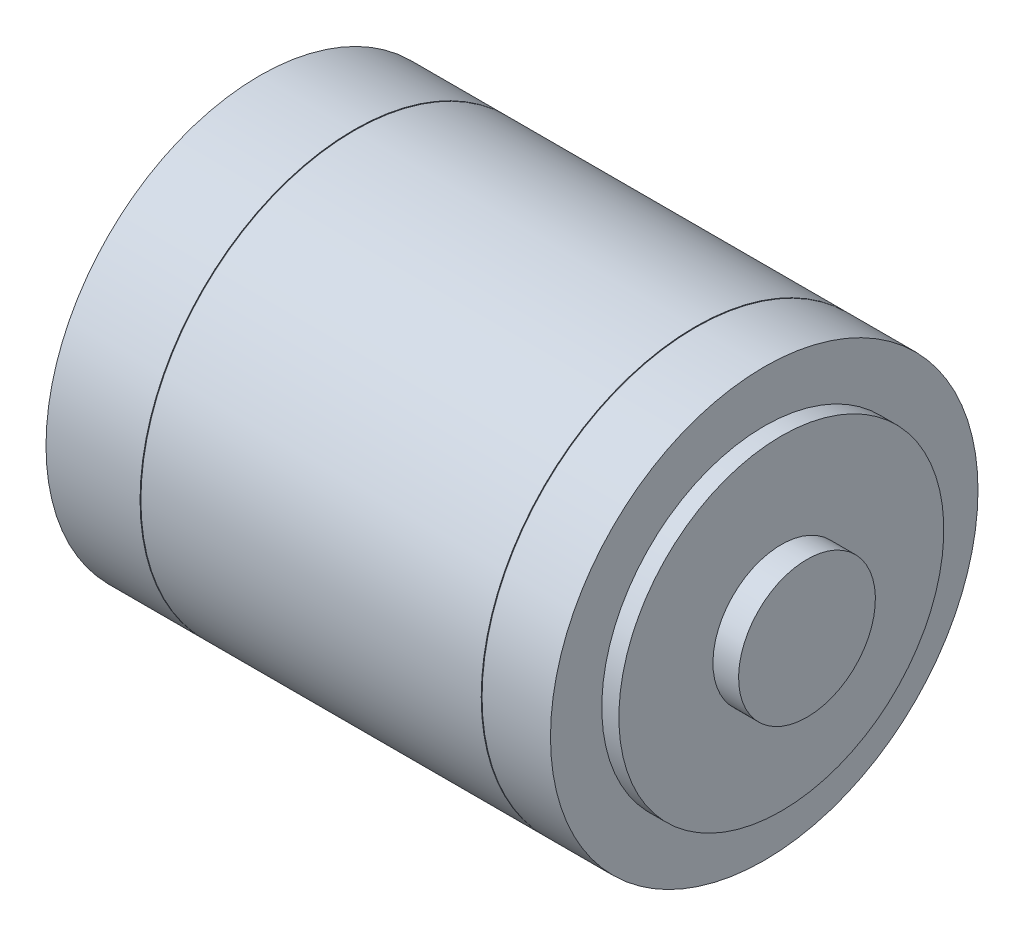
ISO-10303-21;
HEADER;
FILE_DESCRIPTION(('STEP AP214'),'2;1');
FILE_NAME('part.step','',(''),(''),'','','');
FILE_SCHEMA(('AUTOMOTIVE_DESIGN { 1 0 10303 214 1 1 1 1 }'));
ENDSEC;
DATA;
#1=APPLICATION_CONTEXT('core data for automotive mechanical design processes');
#2=APPLICATION_PROTOCOL_DEFINITION('international standard','automotive_design',2000,#1);
#3=PRODUCT_CONTEXT('',#1,'mechanical');
#4=PRODUCT('Part','Part','',(#3));
#5=PRODUCT_RELATED_PRODUCT_CATEGORY('part','',(#4));
#6=PRODUCT_DEFINITION_FORMATION('','',#4);
#7=PRODUCT_DEFINITION_CONTEXT('part definition',#1,'design');
#8=PRODUCT_DEFINITION('design','',#6,#7);
#9=PRODUCT_DEFINITION_SHAPE('','',#8);
#10=(LENGTH_UNIT() NAMED_UNIT(*) SI_UNIT(.MILLI.,.METRE.));
#11=(NAMED_UNIT(*) PLANE_ANGLE_UNIT() SI_UNIT($,.RADIAN.));
#12=(NAMED_UNIT(*) SI_UNIT($,.STERADIAN.) SOLID_ANGLE_UNIT());
#13=UNCERTAINTY_MEASURE_WITH_UNIT(LENGTH_MEASURE(1.E-05),#10,'distance_accuracy_value','');
#14=(GEOMETRIC_REPRESENTATION_CONTEXT(3) GLOBAL_UNCERTAINTY_ASSIGNED_CONTEXT((#13)) GLOBAL_UNIT_ASSIGNED_CONTEXT((#10,
#11,#12)) REPRESENTATION_CONTEXT('',''));
#15=CARTESIAN_POINT('',(0.,0.,0.));
#16=DIRECTION('',(0.,0.,1.));
#17=DIRECTION('',(1.,0.,0.));
#18=AXIS2_PLACEMENT_3D('',#15,#16,#17);
#19=CARTESIAN_POINT('',(-64.,15.,0.));
#20=DIRECTION('',(1.,0.,0.));
#21=DIRECTION('',(0.,1.,0.));
#22=AXIS2_PLACEMENT_3D('',#19,#20,#21);
#23=PLANE('',#22);
#24=CARTESIAN_POINT('',(-64.,-9.99999999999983,-17.3205080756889));
#25=DIRECTION('',(-1.,0.,0.));
#26=DIRECTION('',(0.,0.,1.));
#27=AXIS2_PLACEMENT_3D('',#24,#25,#26);
#28=CIRCLE('',#27,2.09999999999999);
#29=CARTESIAN_POINT('',(-64.,-9.99999999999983,-15.2205080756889));
#30=VERTEX_POINT('',#29);
#31=EDGE_CURVE('E84',#30,#30,#28,.T.);
#32=ORIENTED_EDGE('',*,*,#31,.F.);
#33=EDGE_LOOP('',(#32));
#34=FACE_BOUND('',#33,.T.);
#35=CARTESIAN_POINT('',(-64.,-10.0000000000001,17.3205080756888));
#36=DIRECTION('',(-1.,0.,0.));
#37=DIRECTION('',(0.,0.,1.));
#38=AXIS2_PLACEMENT_3D('',#35,#36,#37);
#39=CIRCLE('',#38,2.09999999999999);
#40=CARTESIAN_POINT('',(-64.,-10.0000000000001,19.4205080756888));
#41=VERTEX_POINT('',#40);
#42=EDGE_CURVE('E96',#41,#41,#39,.T.);
#43=ORIENTED_EDGE('',*,*,#42,.F.);
#44=EDGE_LOOP('',(#43));
#45=FACE_BOUND('',#44,.T.);
#46=CARTESIAN_POINT('',(-64.,0.,0.));
#47=DIRECTION('',(-1.,0.,0.));
#48=DIRECTION('',(0.,-1.,0.));
#49=AXIS2_PLACEMENT_3D('',#46,#47,#48);
#50=CIRCLE('',#49,25.);
#51=CARTESIAN_POINT('',(-64.,-25.,0.));
#52=VERTEX_POINT('',#51);
#53=EDGE_CURVE('E114',#52,#52,#50,.T.);
#54=ORIENTED_EDGE('',*,*,#53,.T.);
#55=EDGE_LOOP('',(#54));
#56=FACE_BOUND('',#55,.T.);
#57=CARTESIAN_POINT('',(-64.,0.,0.));
#58=DIRECTION('',(-1.,0.,0.));
#59=DIRECTION('',(0.,-1.,0.));
#60=AXIS2_PLACEMENT_3D('',#57,#58,#59);
#61=CIRCLE('',#60,15.);
#62=CARTESIAN_POINT('',(-64.,-15.,0.));
#63=VERTEX_POINT('',#62);
#64=EDGE_CURVE('E111',#63,#63,#61,.T.);
#65=ORIENTED_EDGE('',*,*,#64,.F.);
#66=EDGE_LOOP('',(#65));
#67=FACE_BOUND('',#66,.T.);
#68=CARTESIAN_POINT('',(-64.,20.,0.));
#69=DIRECTION('',(-1.,0.,0.));
#70=DIRECTION('',(0.,0.,1.));
#71=AXIS2_PLACEMENT_3D('',#68,#69,#70);
#72=CIRCLE('',#71,2.09999999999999);
#73=CARTESIAN_POINT('',(-64.,20.,2.10000000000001));
#74=VERTEX_POINT('',#73);
#75=EDGE_CURVE('E108',#74,#74,#72,.T.);
#76=ORIENTED_EDGE('',*,*,#75,.F.);
#77=EDGE_LOOP('',(#76));
#78=FACE_BOUND('',#77,.T.);
#79=CARTESIAN_POINT('',(-64.,9.99999999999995,17.3205080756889));
#80=DIRECTION('',(-1.,0.,0.));
#81=DIRECTION('',(0.,0.,1.));
#82=AXIS2_PLACEMENT_3D('',#79,#80,#81);
#83=CIRCLE('',#82,2.09999999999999);
#84=CARTESIAN_POINT('',(-64.,9.99999999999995,19.4205080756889));
#85=VERTEX_POINT('',#84);
#86=EDGE_CURVE('E102',#85,#85,#83,.T.);
#87=ORIENTED_EDGE('',*,*,#86,.F.);
#88=EDGE_LOOP('',(#87));
#89=FACE_BOUND('',#88,.T.);
#90=CARTESIAN_POINT('',(-64.,-20.,-1.37643350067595E-13));
#91=DIRECTION('',(-1.,0.,0.));
#92=DIRECTION('',(0.,0.,1.));
#93=AXIS2_PLACEMENT_3D('',#90,#91,#92);
#94=CIRCLE('',#93,2.09999999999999);
#95=CARTESIAN_POINT('',(-64.,-20.,2.09999999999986));
#96=VERTEX_POINT('',#95);
#97=EDGE_CURVE('E90',#96,#96,#94,.T.);
#98=ORIENTED_EDGE('',*,*,#97,.F.);
#99=EDGE_LOOP('',(#98));
#100=FACE_BOUND('',#99,.T.);
#101=CARTESIAN_POINT('',(-64.,10.0000000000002,-17.3205080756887));
#102=DIRECTION('',(-1.,0.,0.));
#103=DIRECTION('',(0.,0.,1.));
#104=AXIS2_PLACEMENT_3D('',#101,#102,#103);
#105=CIRCLE('',#104,2.09999999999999);
#106=CARTESIAN_POINT('',(-64.,10.0000000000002,-15.2205080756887));
#107=VERTEX_POINT('',#106);
#108=EDGE_CURVE('E76',#107,#107,#105,.T.);
#109=ORIENTED_EDGE('',*,*,#108,.F.);
#110=EDGE_LOOP('',(#109));
#111=FACE_BOUND('',#110,.T.);
#112=ADVANCED_FACE('F38',(#34,#45,#56,#67,#78,#89,#100,#111),#23,.F.);
#113=CARTESIAN_POINT('',(0.,8.00000000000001,0.));
#114=DIRECTION('',(-1.,0.,0.));
#115=DIRECTION('',(0.,-1.,0.));
#116=AXIS2_PLACEMENT_3D('',#113,#114,#115);
#117=PLANE('',#116);
#118=CARTESIAN_POINT('',(0.,0.,0.));
#119=DIRECTION('',(-1.,0.,0.));
#120=DIRECTION('',(0.,-1.,0.));
#121=AXIS2_PLACEMENT_3D('',#118,#119,#120);
#122=CIRCLE('',#121,8.);
#123=CARTESIAN_POINT('',(0.,-8.,0.));
#124=VERTEX_POINT('',#123);
#125=EDGE_CURVE('E153',#124,#124,#122,.T.);
#126=ORIENTED_EDGE('',*,*,#125,.F.);
#127=EDGE_LOOP('',(#126));
#128=FACE_BOUND('',#127,.T.);
#129=ADVANCED_FACE('F198',(#128),#117,.F.);
#130=CARTESIAN_POINT('',(-92.,0.,0.));
#131=DIRECTION('',(-1.,0.,0.));
#132=DIRECTION('',(0.,-1.,0.));
#133=AXIS2_PLACEMENT_3D('',#130,#131,#132);
#134=CYLINDRICAL_SURFACE('',#133,8.);
#135=CARTESIAN_POINT('',(-3.,0.,0.));
#136=DIRECTION('',(-1.,0.,0.));
#137=DIRECTION('',(0.,-1.,0.));
#138=AXIS2_PLACEMENT_3D('',#135,#136,#137);
#139=CIRCLE('',#138,8.);
#140=CARTESIAN_POINT('',(-2.99999999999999,-8.,0.));
#141=VERTEX_POINT('',#140);
#142=EDGE_CURVE('E150',#141,#141,#139,.T.);
#143=ORIENTED_EDGE('',*,*,#142,.F.);
#144=EDGE_LOOP('',(#143));
#145=FACE_BOUND('',#144,.T.);
#146=ORIENTED_EDGE('',*,*,#125,.T.);
#147=EDGE_LOOP('',(#146));
#148=FACE_BOUND('',#147,.T.);
#149=ADVANCED_FACE('F204',(#145,#148),#134,.T.);
#150=CARTESIAN_POINT('',(-3.,19.,0.));
#151=DIRECTION('',(-1.,0.,0.));
#152=DIRECTION('',(0.,-1.,0.));
#153=AXIS2_PLACEMENT_3D('',#150,#151,#152);
#154=PLANE('',#153);
#155=CARTESIAN_POINT('',(-3.,0.,0.));
#156=DIRECTION('',(-1.,0.,0.));
#157=DIRECTION('',(0.,-1.,0.));
#158=AXIS2_PLACEMENT_3D('',#155,#156,#157);
#159=CIRCLE('',#158,19.);
#160=CARTESIAN_POINT('',(-2.99999999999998,-19.,0.));
#161=VERTEX_POINT('',#160);
#162=EDGE_CURVE('E147',#161,#161,#159,.T.);
#163=ORIENTED_EDGE('',*,*,#162,.F.);
#164=EDGE_LOOP('',(#163));
#165=FACE_BOUND('',#164,.T.);
#166=ORIENTED_EDGE('',*,*,#142,.T.);
#167=EDGE_LOOP('',(#166));
#168=FACE_BOUND('',#167,.T.);
#169=ADVANCED_FACE('F256',(#165,#168),#154,.F.);
#170=CARTESIAN_POINT('',(-92.,0.,0.));
#171=DIRECTION('',(-1.,0.,0.));
#172=DIRECTION('',(0.,-1.,0.));
#173=AXIS2_PLACEMENT_3D('',#170,#171,#172);
#174=CYLINDRICAL_SURFACE('',#173,19.);
#175=CARTESIAN_POINT('',(-5.,0.,0.));
#176=DIRECTION('',(-1.,0.,0.));
#177=DIRECTION('',(0.,-1.,0.));
#178=AXIS2_PLACEMENT_3D('',#175,#176,#177);
#179=CIRCLE('',#178,19.);
#180=CARTESIAN_POINT('',(-4.99999999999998,-19.,0.));
#181=VERTEX_POINT('',#180);
#182=EDGE_CURVE('E144',#181,#181,#179,.T.);
#183=ORIENTED_EDGE('',*,*,#182,.F.);
#184=EDGE_LOOP('',(#183));
#185=FACE_BOUND('',#184,.T.);
#186=ORIENTED_EDGE('',*,*,#162,.T.);
#187=EDGE_LOOP('',(#186));
#188=FACE_BOUND('',#187,.T.);
#189=ADVANCED_FACE('F252',(#185,#188),#174,.T.);
#190=CARTESIAN_POINT('',(-5.,25.,0.));
#191=DIRECTION('',(-1.,0.,0.));
#192=DIRECTION('',(0.,-1.,0.));
#193=AXIS2_PLACEMENT_3D('',#190,#191,#192);
#194=PLANE('',#193);
#195=CARTESIAN_POINT('',(-5.,0.,0.));
#196=DIRECTION('',(-1.,0.,0.));
#197=DIRECTION('',(0.,-1.,0.));
#198=AXIS2_PLACEMENT_3D('',#195,#196,#197);
#199=CIRCLE('',#198,25.);
#200=CARTESIAN_POINT('',(-4.99999999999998,-25.,0.));
#201=VERTEX_POINT('',#200);
#202=EDGE_CURVE('E141',#201,#201,#199,.T.);
#203=ORIENTED_EDGE('',*,*,#202,.F.);
#204=EDGE_LOOP('',(#203));
#205=FACE_BOUND('',#204,.T.);
#206=ORIENTED_EDGE('',*,*,#182,.T.);
#207=EDGE_LOOP('',(#206));
#208=FACE_BOUND('',#207,.T.);
#209=ADVANCED_FACE('F248',(#205,#208),#194,.F.);
#210=CARTESIAN_POINT('',(-92.,0.,0.));
#211=DIRECTION('',(-1.,0.,0.));
#212=DIRECTION('',(0.,-1.,0.));
#213=AXIS2_PLACEMENT_3D('',#210,#211,#212);
#214=CYLINDRICAL_SURFACE('',#213,25.);
#215=CARTESIAN_POINT('',(-13.,0.,0.));
#216=DIRECTION('',(-1.,0.,0.));
#217=DIRECTION('',(0.,-1.,0.));
#218=AXIS2_PLACEMENT_3D('',#215,#216,#217);
#219=CIRCLE('',#218,25.);
#220=CARTESIAN_POINT('',(-13.,-25.,0.));
#221=VERTEX_POINT('',#220);
#222=EDGE_CURVE('E138',#221,#221,#219,.T.);
#223=ORIENTED_EDGE('',*,*,#222,.F.);
#224=EDGE_LOOP('',(#223));
#225=FACE_BOUND('',#224,.T.);
#226=ORIENTED_EDGE('',*,*,#202,.T.);
#227=EDGE_LOOP('',(#226));
#228=FACE_BOUND('',#227,.T.);
#229=ADVANCED_FACE('F244',(#225,#228),#214,.T.);
#230=CARTESIAN_POINT('',(-13.,24.9,0.));
#231=DIRECTION('',(1.,0.,0.));
#232=DIRECTION('',(0.,1.,0.));
#233=AXIS2_PLACEMENT_3D('',#230,#231,#232);
#234=PLANE('',#233);
#235=CARTESIAN_POINT('',(-13.,0.,0.));
#236=DIRECTION('',(-1.,0.,0.));
#237=DIRECTION('',(0.,-1.,0.));
#238=AXIS2_PLACEMENT_3D('',#235,#236,#237);
#239=CIRCLE('',#238,24.9);
#240=CARTESIAN_POINT('',(-13.,-24.9,0.));
#241=VERTEX_POINT('',#240);
#242=EDGE_CURVE('E135',#241,#241,#239,.T.);
#243=ORIENTED_EDGE('',*,*,#242,.F.);
#244=EDGE_LOOP('',(#243));
#245=FACE_BOUND('',#244,.T.);
#246=ORIENTED_EDGE('',*,*,#222,.T.);
#247=EDGE_LOOP('',(#246));
#248=FACE_BOUND('',#247,.T.);
#249=ADVANCED_FACE('F240',(#245,#248),#234,.F.);
#250=CARTESIAN_POINT('',(-92.,0.,0.));
#251=DIRECTION('',(-1.,0.,0.));
#252=DIRECTION('',(0.,-1.,0.));
#253=AXIS2_PLACEMENT_3D('',#250,#251,#252);
#254=CYLINDRICAL_SURFACE('',#253,24.9);
#255=CARTESIAN_POINT('',(-13.1,0.,0.));
#256=DIRECTION('',(-1.,0.,0.));
#257=DIRECTION('',(0.,-1.,0.));
#258=AXIS2_PLACEMENT_3D('',#255,#256,#257);
#259=CIRCLE('',#258,24.9);
#260=CARTESIAN_POINT('',(-13.1,-24.9,0.));
#261=VERTEX_POINT('',#260);
#262=EDGE_CURVE('E132',#261,#261,#259,.T.);
#263=ORIENTED_EDGE('',*,*,#262,.F.);
#264=EDGE_LOOP('',(#263));
#265=FACE_BOUND('',#264,.T.);
#266=ORIENTED_EDGE('',*,*,#242,.T.);
#267=EDGE_LOOP('',(#266));
#268=FACE_BOUND('',#267,.T.);
#269=ADVANCED_FACE('F236',(#265,#268),#254,.T.);
#270=CARTESIAN_POINT('',(-13.1,25.,0.));
#271=DIRECTION('',(-1.,0.,0.));
#272=DIRECTION('',(0.,-1.,0.));
#273=AXIS2_PLACEMENT_3D('',#270,#271,#272);
#274=PLANE('',#273);
#275=CARTESIAN_POINT('',(-13.1,0.,0.));
#276=DIRECTION('',(-1.,0.,0.));
#277=DIRECTION('',(0.,-1.,0.));
#278=AXIS2_PLACEMENT_3D('',#275,#276,#277);
#279=CIRCLE('',#278,25.);
#280=CARTESIAN_POINT('',(-13.1,-25.,0.));
#281=VERTEX_POINT('',#280);
#282=EDGE_CURVE('E129',#281,#281,#279,.T.);
#283=ORIENTED_EDGE('',*,*,#282,.F.);
#284=EDGE_LOOP('',(#283));
#285=FACE_BOUND('',#284,.T.);
#286=ORIENTED_EDGE('',*,*,#262,.T.);
#287=EDGE_LOOP('',(#286));
#288=FACE_BOUND('',#287,.T.);
#289=ADVANCED_FACE('F232',(#285,#288),#274,.F.);
#290=CARTESIAN_POINT('',(-92.,0.,0.));
#291=DIRECTION('',(-1.,0.,0.));
#292=DIRECTION('',(0.,-1.,0.));
#293=AXIS2_PLACEMENT_3D('',#290,#291,#292);
#294=CYLINDRICAL_SURFACE('',#293,25.);
#295=CARTESIAN_POINT('',(-52.9000000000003,0.,0.));
#296=DIRECTION('',(-1.,0.,0.));
#297=DIRECTION('',(0.,-1.,0.));
#298=AXIS2_PLACEMENT_3D('',#295,#296,#297);
#299=CIRCLE('',#298,25.);
#300=CARTESIAN_POINT('',(-52.9000000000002,-25.,0.));
#301=VERTEX_POINT('',#300);
#302=EDGE_CURVE('E126',#301,#301,#299,.T.);
#303=ORIENTED_EDGE('',*,*,#302,.F.);
#304=EDGE_LOOP('',(#303));
#305=FACE_BOUND('',#304,.T.);
#306=ORIENTED_EDGE('',*,*,#282,.T.);
#307=EDGE_LOOP('',(#306));
#308=FACE_BOUND('',#307,.T.);
#309=ADVANCED_FACE('F228',(#305,#308),#294,.T.);
#310=CARTESIAN_POINT('',(-52.9000000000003,24.9,0.));
#311=DIRECTION('',(1.,0.,0.));
#312=DIRECTION('',(0.,1.,0.));
#313=AXIS2_PLACEMENT_3D('',#310,#311,#312);
#314=PLANE('',#313);
#315=CARTESIAN_POINT('',(-52.9000000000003,0.,0.));
#316=DIRECTION('',(-1.,0.,0.));
#317=DIRECTION('',(0.,-1.,0.));
#318=AXIS2_PLACEMENT_3D('',#315,#316,#317);
#319=CIRCLE('',#318,24.9);
#320=CARTESIAN_POINT('',(-52.9000000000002,-24.9,0.));
#321=VERTEX_POINT('',#320);
#322=EDGE_CURVE('E123',#321,#321,#319,.T.);
#323=ORIENTED_EDGE('',*,*,#322,.F.);
#324=EDGE_LOOP('',(#323));
#325=FACE_BOUND('',#324,.T.);
#326=ORIENTED_EDGE('',*,*,#302,.T.);
#327=EDGE_LOOP('',(#326));
#328=FACE_BOUND('',#327,.T.);
#329=ADVANCED_FACE('F224',(#325,#328),#314,.F.);
#330=CARTESIAN_POINT('',(-92.,0.,0.));
#331=DIRECTION('',(-1.,0.,0.));
#332=DIRECTION('',(0.,-1.,0.));
#333=AXIS2_PLACEMENT_3D('',#330,#331,#332);
#334=CYLINDRICAL_SURFACE('',#333,24.9);
#335=CARTESIAN_POINT('',(-53.0000000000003,0.,0.));
#336=DIRECTION('',(-1.,0.,0.));
#337=DIRECTION('',(0.,-1.,0.));
#338=AXIS2_PLACEMENT_3D('',#335,#336,#337);
#339=CIRCLE('',#338,24.9);
#340=CARTESIAN_POINT('',(-53.0000000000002,-24.9,0.));
#341=VERTEX_POINT('',#340);
#342=EDGE_CURVE('E120',#341,#341,#339,.T.);
#343=ORIENTED_EDGE('',*,*,#342,.F.);
#344=EDGE_LOOP('',(#343));
#345=FACE_BOUND('',#344,.T.);
#346=ORIENTED_EDGE('',*,*,#322,.T.);
#347=EDGE_LOOP('',(#346));
#348=FACE_BOUND('',#347,.T.);
#349=ADVANCED_FACE('F220',(#345,#348),#334,.T.);
#350=CARTESIAN_POINT('',(-53.0000000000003,25.,0.));
#351=DIRECTION('',(-1.,0.,0.));
#352=DIRECTION('',(0.,-1.,0.));
#353=AXIS2_PLACEMENT_3D('',#350,#351,#352);
#354=PLANE('',#353);
#355=CARTESIAN_POINT('',(-53.0000000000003,0.,0.));
#356=DIRECTION('',(-1.,0.,0.));
#357=DIRECTION('',(0.,-1.,0.));
#358=AXIS2_PLACEMENT_3D('',#355,#356,#357);
#359=CIRCLE('',#358,25.);
#360=CARTESIAN_POINT('',(-53.0000000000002,-25.,0.));
#361=VERTEX_POINT('',#360);
#362=EDGE_CURVE('E117',#361,#361,#359,.T.);
#363=ORIENTED_EDGE('',*,*,#362,.F.);
#364=EDGE_LOOP('',(#363));
#365=FACE_BOUND('',#364,.T.);
#366=ORIENTED_EDGE('',*,*,#342,.T.);
#367=EDGE_LOOP('',(#366));
#368=FACE_BOUND('',#367,.T.);
#369=ADVANCED_FACE('F216',(#365,#368),#354,.F.);
#370=CARTESIAN_POINT('',(-92.,0.,0.));
#371=DIRECTION('',(-1.,0.,0.));
#372=DIRECTION('',(0.,-1.,0.));
#373=AXIS2_PLACEMENT_3D('',#370,#371,#372);
#374=CYLINDRICAL_SURFACE('',#373,25.);
#375=ORIENTED_EDGE('',*,*,#53,.F.);
#376=EDGE_LOOP('',(#375));
#377=FACE_BOUND('',#376,.T.);
#378=ORIENTED_EDGE('',*,*,#362,.T.);
#379=EDGE_LOOP('',(#378));
#380=FACE_BOUND('',#379,.T.);
#381=ADVANCED_FACE('F213',(#377,#380),#374,.T.);
#382=CARTESIAN_POINT('',(-92.,0.,0.));
#383=DIRECTION('',(-1.,0.,0.));
#384=DIRECTION('',(0.,-1.,0.));
#385=AXIS2_PLACEMENT_3D('',#382,#383,#384);
#386=CYLINDRICAL_SURFACE('',#385,15.);
#387=CARTESIAN_POINT('',(-66.5,0.,0.));
#388=DIRECTION('',(1.,0.,0.));
#389=DIRECTION('',(0.,1.,0.));
#390=AXIS2_PLACEMENT_3D('',#387,#388,#389);
#391=CIRCLE('',#390,15.);
#392=CARTESIAN_POINT('',(-66.5,15.,0.));
#393=VERTEX_POINT('',#392);
#394=EDGE_CURVE('E11',#393,#393,#391,.T.);
#395=ORIENTED_EDGE('',*,*,#394,.T.);
#396=EDGE_LOOP('',(#395));
#397=FACE_BOUND('',#396,.T.);
#398=ORIENTED_EDGE('',*,*,#64,.T.);
#399=EDGE_LOOP('',(#398));
#400=FACE_BOUND('',#399,.T.);
#401=ADVANCED_FACE('F211',(#397,#400),#386,.T.);
#402=CARTESIAN_POINT('',(-67.,0.,0.));
#403=DIRECTION('',(1.,0.,0.));
#404=DIRECTION('',(0.,1.,0.));
#405=AXIS2_PLACEMENT_3D('',#402,#403,#404);
#406=PLANE('',#405);
#407=CARTESIAN_POINT('',(-67.,0.,0.));
#408=DIRECTION('',(1.,0.,0.));
#409=DIRECTION('',(0.,1.,0.));
#410=AXIS2_PLACEMENT_3D('',#407,#408,#409);
#411=CIRCLE('',#410,14.5);
#412=CARTESIAN_POINT('',(-67.,14.5,0.));
#413=VERTEX_POINT('',#412);
#414=EDGE_CURVE('E47',#413,#413,#411,.F.);
#415=ORIENTED_EDGE('',*,*,#414,.T.);
#416=EDGE_LOOP('',(#415));
#417=FACE_BOUND('',#416,.T.);
#418=ADVANCED_FACE('F188',(#417),#406,.F.);
#419=CARTESIAN_POINT('',(-64.,20.,0.));
#420=DIRECTION('',(-1.,0.,0.));
#421=DIRECTION('',(0.,0.,1.));
#422=AXIS2_PLACEMENT_3D('',#419,#420,#421);
#423=CYLINDRICAL_SURFACE('',#422,2.09999999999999);
#424=CARTESIAN_POINT('',(-50.0000000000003,20.,0.));
#425=DIRECTION('',(-1.,0.,0.));
#426=DIRECTION('',(0.,0.,1.));
#427=AXIS2_PLACEMENT_3D('',#424,#425,#426);
#428=CIRCLE('',#427,2.09999999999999);
#429=CARTESIAN_POINT('',(-50.0000000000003,20.,2.1));
#430=VERTEX_POINT('',#429);
#431=EDGE_CURVE('E105',#430,#430,#428,.T.);
#432=ORIENTED_EDGE('',*,*,#431,.F.);
#433=EDGE_LOOP('',(#432));
#434=FACE_BOUND('',#433,.T.);
#435=ORIENTED_EDGE('',*,*,#75,.T.);
#436=EDGE_LOOP('',(#435));
#437=FACE_BOUND('',#436,.T.);
#438=ADVANCED_FACE('F490',(#434,#437),#423,.F.);
#439=CARTESIAN_POINT('',(-50.0000000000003,20.,0.));
#440=DIRECTION('',(-1.,0.,0.));
#441=DIRECTION('',(0.,0.,1.));
#442=AXIS2_PLACEMENT_3D('',#439,#440,#441);
#443=CONICAL_SURFACE('',#442,2.09999999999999,1.04719755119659);
#444=CARTESIAN_POINT('',(-48.7875644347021,20.,0.));
#445=VERTEX_POINT('',#444);
#446=VERTEX_LOOP('',#445);
#447=FACE_BOUND('',#446,.T.);
#448=ORIENTED_EDGE('',*,*,#431,.T.);
#449=EDGE_LOOP('',(#448));
#450=FACE_BOUND('',#449,.T.);
#451=ADVANCED_FACE('F479',(#447,#450),#443,.F.);
#452=CARTESIAN_POINT('',(-64.,9.99999999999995,17.3205080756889));
#453=DIRECTION('',(-1.,0.,0.));
#454=DIRECTION('',(0.,0.,1.));
#455=AXIS2_PLACEMENT_3D('',#452,#453,#454);
#456=CYLINDRICAL_SURFACE('',#455,2.09999999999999);
#457=CARTESIAN_POINT('',(-50.0000000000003,9.99999999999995,17.3205080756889));
#458=DIRECTION('',(-1.,0.,0.));
#459=DIRECTION('',(0.,0.,1.));
#460=AXIS2_PLACEMENT_3D('',#457,#458,#459);
#461=CIRCLE('',#460,2.09999999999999);
#462=CARTESIAN_POINT('',(-50.0000000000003,9.99999999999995,19.4205080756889));
#463=VERTEX_POINT('',#462);
#464=EDGE_CURVE('E99',#463,#463,#461,.T.);
#465=ORIENTED_EDGE('',*,*,#464,.F.);
#466=EDGE_LOOP('',(#465));
#467=FACE_BOUND('',#466,.T.);
#468=ORIENTED_EDGE('',*,*,#86,.T.);
#469=EDGE_LOOP('',(#468));
#470=FACE_BOUND('',#469,.T.);
#471=ADVANCED_FACE('F470',(#467,#470),#456,.F.);
#472=CARTESIAN_POINT('',(-50.0000000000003,9.99999999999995,17.3205080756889));
#473=DIRECTION('',(-1.,0.,0.));
#474=DIRECTION('',(0.,0.,1.));
#475=AXIS2_PLACEMENT_3D('',#472,#473,#474);
#476=CONICAL_SURFACE('',#475,2.09999999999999,1.04719755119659);
#477=CARTESIAN_POINT('',(-48.7875644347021,9.99999999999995,17.3205080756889));
#478=VERTEX_POINT('',#477);
#479=VERTEX_LOOP('',#478);
#480=FACE_BOUND('',#479,.T.);
#481=ORIENTED_EDGE('',*,*,#464,.T.);
#482=EDGE_LOOP('',(#481));
#483=FACE_BOUND('',#482,.T.);
#484=ADVANCED_FACE('F460',(#480,#483),#476,.F.);
#485=CARTESIAN_POINT('',(-64.,-10.0000000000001,17.3205080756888));
#486=DIRECTION('',(-1.,0.,0.));
#487=DIRECTION('',(0.,0.,1.));
#488=AXIS2_PLACEMENT_3D('',#485,#486,#487);
#489=CYLINDRICAL_SURFACE('',#488,2.09999999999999);
#490=CARTESIAN_POINT('',(-50.,-10.0000000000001,17.3205080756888));
#491=DIRECTION('',(-1.,0.,0.));
#492=DIRECTION('',(0.,0.,1.));
#493=AXIS2_PLACEMENT_3D('',#490,#491,#492);
#494=CIRCLE('',#493,2.09999999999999);
#495=CARTESIAN_POINT('',(-50.,-10.0000000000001,19.4205080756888));
#496=VERTEX_POINT('',#495);
#497=EDGE_CURVE('E93',#496,#496,#494,.T.);
#498=ORIENTED_EDGE('',*,*,#497,.F.);
#499=EDGE_LOOP('',(#498));
#500=FACE_BOUND('',#499,.T.);
#501=ORIENTED_EDGE('',*,*,#42,.T.);
#502=EDGE_LOOP('',(#501));
#503=FACE_BOUND('',#502,.T.);
#504=ADVANCED_FACE('F450',(#500,#503),#489,.F.);
#505=CARTESIAN_POINT('',(-50.,-10.0000000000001,17.3205080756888));
#506=DIRECTION('',(-1.,0.,0.));
#507=DIRECTION('',(0.,0.,1.));
#508=AXIS2_PLACEMENT_3D('',#505,#506,#507);
#509=CONICAL_SURFACE('',#508,2.09999999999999,1.04719755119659);
#510=CARTESIAN_POINT('',(-48.7875644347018,-10.0000000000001,17.3205080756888));
#511=VERTEX_POINT('',#510);
#512=VERTEX_LOOP('',#511);
#513=FACE_BOUND('',#512,.T.);
#514=ORIENTED_EDGE('',*,*,#497,.T.);
#515=EDGE_LOOP('',(#514));
#516=FACE_BOUND('',#515,.T.);
#517=ADVANCED_FACE('F440',(#513,#516),#509,.F.);
#518=CARTESIAN_POINT('',(-64.,-20.,-1.37643350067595E-13));
#519=DIRECTION('',(-1.,0.,0.));
#520=DIRECTION('',(0.,0.,1.));
#521=AXIS2_PLACEMENT_3D('',#518,#519,#520);
#522=CYLINDRICAL_SURFACE('',#521,2.09999999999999);
#523=CARTESIAN_POINT('',(-50.,-20.,-1.38941759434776E-13));
#524=DIRECTION('',(-1.,0.,0.));
#525=DIRECTION('',(0.,0.,1.));
#526=AXIS2_PLACEMENT_3D('',#523,#524,#525);
#527=CIRCLE('',#526,2.09999999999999);
#528=CARTESIAN_POINT('',(-50.,-20.,2.09999999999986));
#529=VERTEX_POINT('',#528);
#530=EDGE_CURVE('E87',#529,#529,#527,.T.);
#531=ORIENTED_EDGE('',*,*,#530,.F.);
#532=EDGE_LOOP('',(#531));
#533=FACE_BOUND('',#532,.T.);
#534=ORIENTED_EDGE('',*,*,#97,.T.);
#535=EDGE_LOOP('',(#534));
#536=FACE_BOUND('',#535,.T.);
#537=ADVANCED_FACE('F430',(#533,#536),#522,.F.);
#538=CARTESIAN_POINT('',(-50.,-20.,-1.38941759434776E-13));
#539=DIRECTION('',(-1.,0.,0.));
#540=DIRECTION('',(0.,0.,1.));
#541=AXIS2_PLACEMENT_3D('',#538,#539,#540);
#542=CONICAL_SURFACE('',#541,2.09999999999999,1.04719755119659);
#543=CARTESIAN_POINT('',(-48.7875644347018,-20.,-1.39054204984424E-13));
#544=VERTEX_POINT('',#543);
#545=VERTEX_LOOP('',#544);
#546=FACE_BOUND('',#545,.T.);
#547=ORIENTED_EDGE('',*,*,#530,.T.);
#548=EDGE_LOOP('',(#547));
#549=FACE_BOUND('',#548,.T.);
#550=ADVANCED_FACE('F420',(#546,#549),#542,.F.);
#551=CARTESIAN_POINT('',(-64.,-9.99999999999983,-17.3205080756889));
#552=DIRECTION('',(-1.,0.,0.));
#553=DIRECTION('',(0.,0.,1.));
#554=AXIS2_PLACEMENT_3D('',#551,#552,#553);
#555=CYLINDRICAL_SURFACE('',#554,2.09999999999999);
#556=CARTESIAN_POINT('',(-50.,-9.99999999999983,-17.3205080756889));
#557=DIRECTION('',(-1.,0.,0.));
#558=DIRECTION('',(0.,0.,1.));
#559=AXIS2_PLACEMENT_3D('',#556,#557,#558);
#560=CIRCLE('',#559,2.09999999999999);
#561=CARTESIAN_POINT('',(-50.,-9.99999999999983,-15.2205080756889));
#562=VERTEX_POINT('',#561);
#563=EDGE_CURVE('E79',#562,#562,#560,.T.);
#564=ORIENTED_EDGE('',*,*,#563,.F.);
#565=EDGE_LOOP('',(#564));
#566=FACE_BOUND('',#565,.T.);
#567=ORIENTED_EDGE('',*,*,#31,.T.);
#568=EDGE_LOOP('',(#567));
#569=FACE_BOUND('',#568,.T.);
#570=ADVANCED_FACE('F410',(#566,#569),#555,.F.);
#571=CARTESIAN_POINT('',(-50.,-9.99999999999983,-17.3205080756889));
#572=DIRECTION('',(-1.,0.,0.));
#573=DIRECTION('',(0.,0.,1.));
#574=AXIS2_PLACEMENT_3D('',#571,#572,#573);
#575=CONICAL_SURFACE('',#574,2.09999999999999,1.04719755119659);
#576=CARTESIAN_POINT('',(-48.7875644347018,-9.99999999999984,-17.3205080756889));
#577=VERTEX_POINT('',#576);
#578=VERTEX_LOOP('',#577);
#579=FACE_BOUND('',#578,.T.);
#580=ORIENTED_EDGE('',*,*,#563,.T.);
#581=EDGE_LOOP('',(#580));
#582=FACE_BOUND('',#581,.T.);
#583=ADVANCED_FACE('F401',(#579,#582),#575,.F.);
#584=CARTESIAN_POINT('',(-64.,10.0000000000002,-17.3205080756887));
#585=DIRECTION('',(-1.,0.,0.));
#586=DIRECTION('',(0.,0.,1.));
#587=AXIS2_PLACEMENT_3D('',#584,#585,#586);
#588=CYLINDRICAL_SURFACE('',#587,2.09999999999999);
#589=CARTESIAN_POINT('',(-50.0000000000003,10.0000000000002,-17.3205080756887));
#590=DIRECTION('',(-1.,0.,0.));
#591=DIRECTION('',(0.,0.,1.));
#592=AXIS2_PLACEMENT_3D('',#589,#590,#591);
#593=CIRCLE('',#592,2.09999999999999);
#594=CARTESIAN_POINT('',(-50.0000000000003,10.0000000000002,-15.2205080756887));
#595=VERTEX_POINT('',#594);
#596=EDGE_CURVE('E74',#595,#595,#593,.T.);
#597=ORIENTED_EDGE('',*,*,#596,.F.);
#598=EDGE_LOOP('',(#597));
#599=FACE_BOUND('',#598,.T.);
#600=ORIENTED_EDGE('',*,*,#108,.T.);
#601=EDGE_LOOP('',(#600));
#602=FACE_BOUND('',#601,.T.);
#603=ADVANCED_FACE('F70',(#599,#602),#588,.F.);
#604=CARTESIAN_POINT('',(-50.0000000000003,10.0000000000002,-17.3205080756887));
#605=DIRECTION('',(-1.,0.,0.));
#606=DIRECTION('',(0.,0.,1.));
#607=AXIS2_PLACEMENT_3D('',#604,#605,#606);
#608=CONICAL_SURFACE('',#607,2.09999999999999,1.04719755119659);
#609=CARTESIAN_POINT('',(-48.7875644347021,10.0000000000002,-17.3205080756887));
#610=VERTEX_POINT('',#609);
#611=VERTEX_LOOP('',#610);
#612=FACE_BOUND('',#611,.T.);
#613=ORIENTED_EDGE('',*,*,#596,.T.);
#614=EDGE_LOOP('',(#613));
#615=FACE_BOUND('',#614,.T.);
#616=ADVANCED_FACE('F66',(#612,#615),#608,.F.);
#617=CARTESIAN_POINT('',(-67.,0.,0.));
#618=DIRECTION('',(1.,0.,0.));
#619=DIRECTION('',(0.,1.,0.));
#620=AXIS2_PLACEMENT_3D('',#617,#618,#619);
#621=CONICAL_SURFACE('',#620,14.5,0.785398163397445);
#622=ORIENTED_EDGE('',*,*,#394,.F.);
#623=EDGE_LOOP('',(#622));
#624=FACE_BOUND('',#623,.T.);
#625=ORIENTED_EDGE('',*,*,#414,.F.);
#626=EDGE_LOOP('',(#625));
#627=FACE_BOUND('',#626,.T.);
#628=ADVANCED_FACE('F69',(#624,#627),#621,.T.);
#629=CLOSED_SHELL('',(#112,#129,#149,#169,#189,#209,#229,#249,#269,#289,#309,#329,#349,#369,
#381,#401,#418,#438,#451,#471,#484,#504,#517,#537,#550,#570,#583,#603,#616,#628));
#630=CARTESIAN_POINT('',(-56.0000000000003,15.,0.));
#631=DIRECTION('',(1.,0.,0.));
#632=DIRECTION('',(0.,1.,0.));
#633=AXIS2_PLACEMENT_3D('',#630,#631,#632);
#634=PLANE('',#633);
#635=CARTESIAN_POINT('',(-56.0000000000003,0.,0.));
#636=DIRECTION('',(1.,0.,0.));
#637=DIRECTION('',(0.,1.,0.));
#638=AXIS2_PLACEMENT_3D('',#635,#636,#637);
#639=CIRCLE('',#638,7.);
#640=CARTESIAN_POINT('',(-56.0000000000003,7.,0.));
#641=VERTEX_POINT('',#640);
#642=EDGE_CURVE('E160',#641,#641,#639,.F.);
#643=ORIENTED_EDGE('',*,*,#642,.T.);
#644=EDGE_LOOP('',(#643));
#645=FACE_BOUND('',#644,.T.);
#646=CARTESIAN_POINT('',(-56.0000000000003,0.,0.));
#647=DIRECTION('',(1.,0.,0.));
#648=DIRECTION('',(0.,1.,0.));
#649=AXIS2_PLACEMENT_3D('',#646,#647,#648);
#650=CIRCLE('',#649,16.9);
#651=CARTESIAN_POINT('',(-56.0000000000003,16.9,0.));
#652=VERTEX_POINT('',#651);
#653=EDGE_CURVE('E156',#652,#652,#650,.F.);
#654=ORIENTED_EDGE('',*,*,#653,.F.);
#655=EDGE_LOOP('',(#654));
#656=FACE_BOUND('',#655,.T.);
#657=ADVANCED_FACE('F264',(#645,#656),#634,.T.);
#658=CARTESIAN_POINT('',(-13.,25.,0.));
#659=DIRECTION('',(-1.,0.,0.));
#660=DIRECTION('',(0.,-1.,0.));
#661=AXIS2_PLACEMENT_3D('',#658,#659,#660);
#662=PLANE('',#661);
#663=CARTESIAN_POINT('',(-13.,0.,0.));
#664=DIRECTION('',(-1.,0.,0.));
#665=DIRECTION('',(0.,-1.,0.));
#666=AXIS2_PLACEMENT_3D('',#663,#664,#665);
#667=CIRCLE('',#666,11.);
#668=CARTESIAN_POINT('',(-13.,-11.,0.));
#669=VERTEX_POINT('',#668);
#670=EDGE_CURVE('E181',#669,#669,#667,.T.);
#671=ORIENTED_EDGE('',*,*,#670,.F.);
#672=EDGE_LOOP('',(#671));
#673=FACE_BOUND('',#672,.T.);
#674=CARTESIAN_POINT('',(-13.,0.,0.));
#675=DIRECTION('',(-1.,0.,0.));
#676=DIRECTION('',(0.,-1.,0.));
#677=AXIS2_PLACEMENT_3D('',#674,#675,#676);
#678=CIRCLE('',#677,16.9);
#679=CARTESIAN_POINT('',(-13.,-16.9,0.));
#680=VERTEX_POINT('',#679);
#681=EDGE_CURVE('E178',#680,#680,#678,.F.);
#682=ORIENTED_EDGE('',*,*,#681,.F.);
#683=EDGE_LOOP('',(#682));
#684=FACE_BOUND('',#683,.T.);
#685=ADVANCED_FACE('F266',(#673,#684),#662,.T.);
#686=CARTESIAN_POINT('',(-11.,19.,0.));
#687=DIRECTION('',(-1.,0.,0.));
#688=DIRECTION('',(0.,-1.,0.));
#689=AXIS2_PLACEMENT_3D('',#686,#687,#688);
#690=PLANE('',#689);
#691=CARTESIAN_POINT('',(-11.,0.,0.));
#692=DIRECTION('',(-1.,0.,0.));
#693=DIRECTION('',(0.,-1.,0.));
#694=AXIS2_PLACEMENT_3D('',#691,#692,#693);
#695=CIRCLE('',#694,11.);
#696=CARTESIAN_POINT('',(-11.,-11.,0.));
#697=VERTEX_POINT('',#696);
#698=EDGE_CURVE('E175',#697,#697,#695,.T.);
#699=ORIENTED_EDGE('',*,*,#698,.T.);
#700=EDGE_LOOP('',(#699));
#701=FACE_BOUND('',#700,.T.);
#702=ADVANCED_FACE('F271',(#701),#690,.T.);
#703=CARTESIAN_POINT('',(-92.,0.,0.));
#704=DIRECTION('',(-1.,0.,0.));
#705=DIRECTION('',(0.,-1.,0.));
#706=AXIS2_PLACEMENT_3D('',#703,#704,#705);
#707=CYLINDRICAL_SURFACE('',#706,11.);
#708=ORIENTED_EDGE('',*,*,#670,.T.);
#709=EDGE_LOOP('',(#708));
#710=FACE_BOUND('',#709,.T.);
#711=ORIENTED_EDGE('',*,*,#698,.F.);
#712=EDGE_LOOP('',(#711));
#713=FACE_BOUND('',#712,.T.);
#714=ADVANCED_FACE('F275',(#710,#713),#707,.F.);
#715=CARTESIAN_POINT('',(-92.,0.,0.));
#716=DIRECTION('',(-1.,0.,0.));
#717=DIRECTION('',(0.,-1.,0.));
#718=AXIS2_PLACEMENT_3D('',#715,#716,#717);
#719=CYLINDRICAL_SURFACE('',#718,16.9);
#720=ORIENTED_EDGE('',*,*,#681,.T.);
#721=EDGE_LOOP('',(#720));
#722=FACE_BOUND('',#721,.T.);
#723=CARTESIAN_POINT('',(-21.1,0.,0.));
#724=DIRECTION('',(-1.,0.,0.));
#725=DIRECTION('',(0.,-1.,0.));
#726=AXIS2_PLACEMENT_3D('',#723,#724,#725);
#727=CIRCLE('',#726,16.9);
#728=CARTESIAN_POINT('',(-21.1,-16.9,0.));
#729=VERTEX_POINT('',#728);
#730=EDGE_CURVE('E172',#729,#729,#727,.T.);
#731=ORIENTED_EDGE('',*,*,#730,.T.);
#732=EDGE_LOOP('',(#731));
#733=FACE_BOUND('',#732,.T.);
#734=ADVANCED_FACE('F279',(#722,#733),#719,.F.);
#735=CARTESIAN_POINT('',(-21.1,25.,0.));
#736=DIRECTION('',(-1.,0.,0.));
#737=DIRECTION('',(0.,-1.,0.));
#738=AXIS2_PLACEMENT_3D('',#735,#736,#737);
#739=PLANE('',#738);
#740=CARTESIAN_POINT('',(-21.1,0.,0.));
#741=DIRECTION('',(-1.,0.,0.));
#742=DIRECTION('',(0.,-1.,0.));
#743=AXIS2_PLACEMENT_3D('',#740,#741,#742);
#744=CIRCLE('',#743,17.);
#745=CARTESIAN_POINT('',(-21.1,-17.,0.));
#746=VERTEX_POINT('',#745);
#747=EDGE_CURVE('E169',#746,#746,#744,.T.);
#748=ORIENTED_EDGE('',*,*,#747,.T.);
#749=EDGE_LOOP('',(#748));
#750=FACE_BOUND('',#749,.T.);
#751=ORIENTED_EDGE('',*,*,#730,.F.);
#752=EDGE_LOOP('',(#751));
#753=FACE_BOUND('',#752,.T.);
#754=ADVANCED_FACE('F283',(#750,#753),#739,.T.);
#755=CARTESIAN_POINT('',(-92.,0.,0.));
#756=DIRECTION('',(-1.,0.,0.));
#757=DIRECTION('',(0.,-1.,0.));
#758=AXIS2_PLACEMENT_3D('',#755,#756,#757);
#759=CYLINDRICAL_SURFACE('',#758,17.);
#760=CARTESIAN_POINT('',(-44.9,0.,0.));
#761=DIRECTION('',(1.,0.,0.));
#762=DIRECTION('',(0.,1.,0.));
#763=AXIS2_PLACEMENT_3D('',#760,#761,#762);
#764=CIRCLE('',#763,17.);
#765=CARTESIAN_POINT('',(-44.9,17.,0.));
#766=VERTEX_POINT('',#765);
#767=EDGE_CURVE('E166',#766,#766,#764,.F.);
#768=ORIENTED_EDGE('',*,*,#767,.T.);
#769=EDGE_LOOP('',(#768));
#770=FACE_BOUND('',#769,.T.);
#771=ORIENTED_EDGE('',*,*,#747,.F.);
#772=EDGE_LOOP('',(#771));
#773=FACE_BOUND('',#772,.T.);
#774=ADVANCED_FACE('F287',(#770,#773),#759,.F.);
#775=CARTESIAN_POINT('',(-44.9,24.9,0.));
#776=DIRECTION('',(1.,0.,0.));
#777=DIRECTION('',(0.,1.,0.));
#778=AXIS2_PLACEMENT_3D('',#775,#776,#777);
#779=PLANE('',#778);
#780=CARTESIAN_POINT('',(-44.9,0.,0.));
#781=DIRECTION('',(1.,0.,0.));
#782=DIRECTION('',(0.,1.,0.));
#783=AXIS2_PLACEMENT_3D('',#780,#781,#782);
#784=CIRCLE('',#783,16.9);
#785=CARTESIAN_POINT('',(-44.9,16.9,0.));
#786=VERTEX_POINT('',#785);
#787=EDGE_CURVE('E163',#786,#786,#784,.F.);
#788=ORIENTED_EDGE('',*,*,#787,.T.);
#789=EDGE_LOOP('',(#788));
#790=FACE_BOUND('',#789,.T.);
#791=ORIENTED_EDGE('',*,*,#767,.F.);
#792=EDGE_LOOP('',(#791));
#793=FACE_BOUND('',#792,.T.);
#794=ADVANCED_FACE('F291',(#790,#793),#779,.T.);
#795=CARTESIAN_POINT('',(-92.,0.,0.));
#796=DIRECTION('',(-1.,0.,0.));
#797=DIRECTION('',(0.,-1.,0.));
#798=AXIS2_PLACEMENT_3D('',#795,#796,#797);
#799=CYLINDRICAL_SURFACE('',#798,16.9);
#800=ORIENTED_EDGE('',*,*,#653,.T.);
#801=EDGE_LOOP('',(#800));
#802=FACE_BOUND('',#801,.T.);
#803=ORIENTED_EDGE('',*,*,#787,.F.);
#804=EDGE_LOOP('',(#803));
#805=FACE_BOUND('',#804,.T.);
#806=ADVANCED_FACE('F295',(#802,#805),#799,.F.);
#807=CARTESIAN_POINT('',(-92.,0.,0.));
#808=DIRECTION('',(-1.,0.,0.));
#809=DIRECTION('',(0.,-1.,0.));
#810=AXIS2_PLACEMENT_3D('',#807,#808,#809);
#811=CYLINDRICAL_SURFACE('',#810,7.);
#812=CARTESIAN_POINT('',(-59.0000000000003,0.,0.));
#813=DIRECTION('',(1.,0.,0.));
#814=DIRECTION('',(0.,1.,0.));
#815=AXIS2_PLACEMENT_3D('',#812,#813,#814);
#816=CIRCLE('',#815,7.);
#817=CARTESIAN_POINT('',(-59.0000000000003,7.,0.));
#818=VERTEX_POINT('',#817);
#819=EDGE_CURVE('E157',#818,#818,#816,.F.);
#820=ORIENTED_EDGE('',*,*,#819,.T.);
#821=EDGE_LOOP('',(#820));
#822=FACE_BOUND('',#821,.T.);
#823=ORIENTED_EDGE('',*,*,#642,.F.);
#824=EDGE_LOOP('',(#823));
#825=FACE_BOUND('',#824,.T.);
#826=ADVANCED_FACE('F298',(#822,#825),#811,.F.);
#827=CARTESIAN_POINT('',(-59.0000000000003,0.,0.));
#828=DIRECTION('',(1.,0.,0.));
#829=DIRECTION('',(0.,1.,0.));
#830=AXIS2_PLACEMENT_3D('',#827,#828,#829);
#831=PLANE('',#830);
#832=ORIENTED_EDGE('',*,*,#819,.F.);
#833=EDGE_LOOP('',(#832));
#834=FACE_BOUND('',#833,.T.);
#835=ADVANCED_FACE('F40',(#834),#831,.T.);
#836=CLOSED_SHELL('',(#657,#685,#702,#714,#734,#754,#774,#794,#806,#826,#835));
#837=ORIENTED_CLOSED_SHELL('',*,#836,.T.);
#838=BREP_WITH_VOIDS('B2',#629,(#837));
#839=ADVANCED_BREP_SHAPE_REPRESENTATION('',(#18,#838),#14);
#840=SHAPE_DEFINITION_REPRESENTATION(#9,#839);
ENDSEC;
END-ISO-10303-21;
